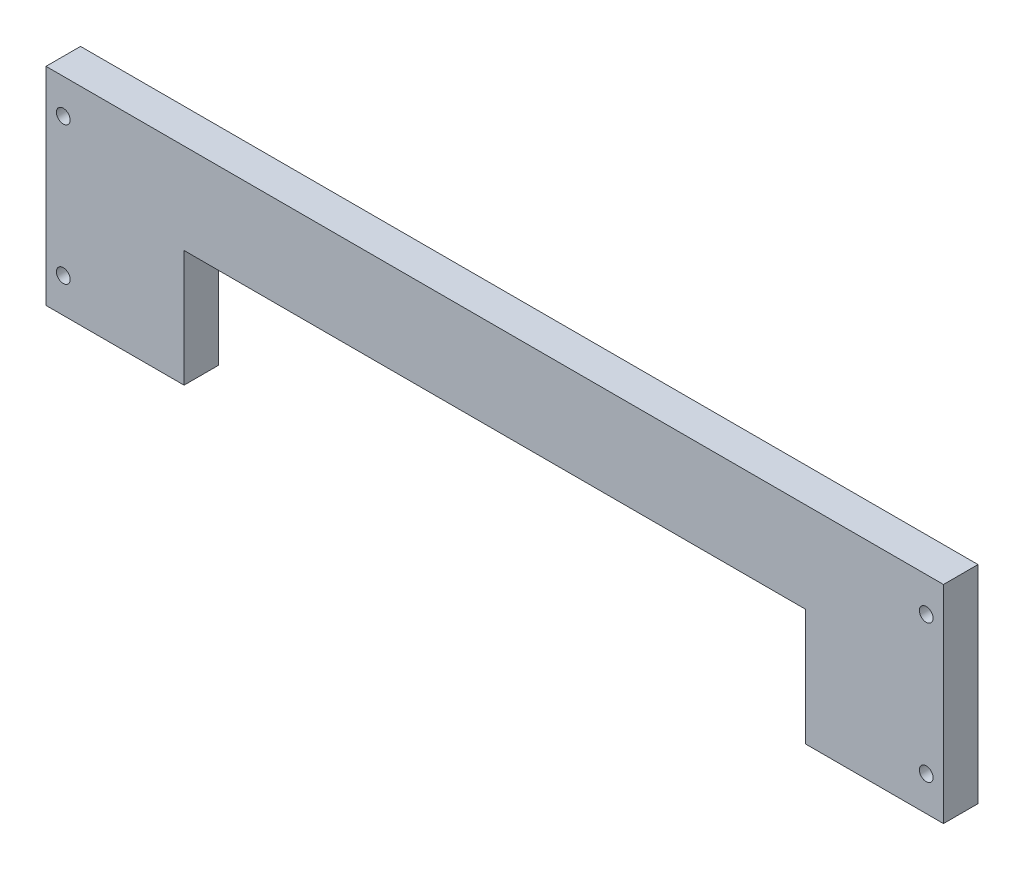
ISO-10303-21;
HEADER;
FILE_DESCRIPTION(('STEP AP214'),'2;1');
FILE_NAME('part.step','',(''),(''),'','','');
FILE_SCHEMA(('AUTOMOTIVE_DESIGN { 1 0 10303 214 1 1 1 1 }'));
ENDSEC;
DATA;
#1=APPLICATION_CONTEXT('core data for automotive mechanical design processes');
#2=APPLICATION_PROTOCOL_DEFINITION('international standard','automotive_design',2000,#1);
#3=PRODUCT_CONTEXT('',#1,'mechanical');
#4=PRODUCT('Part','Part','',(#3));
#5=PRODUCT_RELATED_PRODUCT_CATEGORY('part','',(#4));
#6=PRODUCT_DEFINITION_FORMATION('','',#4);
#7=PRODUCT_DEFINITION_CONTEXT('part definition',#1,'design');
#8=PRODUCT_DEFINITION('design','',#6,#7);
#9=PRODUCT_DEFINITION_SHAPE('','',#8);
#10=(LENGTH_UNIT() NAMED_UNIT(*) SI_UNIT(.MILLI.,.METRE.));
#11=(NAMED_UNIT(*) PLANE_ANGLE_UNIT() SI_UNIT($,.RADIAN.));
#12=(NAMED_UNIT(*) SI_UNIT($,.STERADIAN.) SOLID_ANGLE_UNIT());
#13=UNCERTAINTY_MEASURE_WITH_UNIT(LENGTH_MEASURE(1.E-05),#10,'distance_accuracy_value','');
#14=(GEOMETRIC_REPRESENTATION_CONTEXT(3) GLOBAL_UNCERTAINTY_ASSIGNED_CONTEXT((#13)) GLOBAL_UNIT_ASSIGNED_CONTEXT((#10,
#11,#12)) REPRESENTATION_CONTEXT('',''));
#15=CARTESIAN_POINT('',(0.,0.,0.));
#16=DIRECTION('',(0.,0.,1.));
#17=DIRECTION('',(1.,0.,0.));
#18=AXIS2_PLACEMENT_3D('',#15,#16,#17);
#19=CARTESIAN_POINT('',(-76.4670724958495,-44.9889500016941,12.7));
#20=DIRECTION('',(0.,1.,0.));
#21=DIRECTION('',(-1.,0.,0.));
#22=AXIS2_PLACEMENT_3D('',#19,#20,#21);
#23=PLANE('',#22);
#24=DIRECTION('',(1.,0.,0.));
#25=VECTOR('',#24,1.);
#26=CARTESIAN_POINT('',(-76.4670724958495,-44.9889500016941,12.7));
#27=LINE('',#26,#25);
#28=CARTESIAN_POINT('',(202.93292750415,-44.9889500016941,12.7));
#29=VERTEX_POINT('',#28);
#30=CARTESIAN_POINT('',(253.73292750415,-44.9889500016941,12.7));
#31=VERTEX_POINT('',#30);
#32=EDGE_CURVE('E130',#29,#31,#27,.T.);
#33=ORIENTED_EDGE('',*,*,#32,.F.);
#34=DIRECTION('',(0.,0.,-1.));
#35=VECTOR('',#34,1.);
#36=CARTESIAN_POINT('',(202.93292750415,-44.9889500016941,12.7));
#37=LINE('',#36,#35);
#38=CARTESIAN_POINT('',(202.93292750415,-44.9889500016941,0.));
#39=VERTEX_POINT('',#38);
#40=EDGE_CURVE('E114',#29,#39,#37,.T.);
#41=ORIENTED_EDGE('',*,*,#40,.T.);
#42=DIRECTION('',(1.,0.,0.));
#43=VECTOR('',#42,1.);
#44=CARTESIAN_POINT('',(-76.4670724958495,-44.9889500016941,0.));
#45=LINE('',#44,#43);
#46=CARTESIAN_POINT('',(253.73292750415,-44.9889500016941,0.));
#47=VERTEX_POINT('',#46);
#48=EDGE_CURVE('E157',#39,#47,#45,.T.);
#49=ORIENTED_EDGE('',*,*,#48,.T.);
#50=DIRECTION('',(0.,0.,-1.));
#51=VECTOR('',#50,1.);
#52=CARTESIAN_POINT('',(253.73292750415,-44.9889500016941,12.7));
#53=LINE('',#52,#51);
#54=EDGE_CURVE('E48',#31,#47,#53,.T.);
#55=ORIENTED_EDGE('',*,*,#54,.F.);
#56=EDGE_LOOP('',(#33,#41,#49,#55));
#57=FACE_BOUND('',#56,.T.);
#58=ADVANCED_FACE('F39',(#57),#23,.F.);
#59=CARTESIAN_POINT('',(-76.4670724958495,31.2110499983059,12.7));
#60=DIRECTION('',(1.,0.,0.));
#61=DIRECTION('',(0.,0.,-1.));
#62=AXIS2_PLACEMENT_3D('',#59,#60,#61);
#63=PLANE('',#62);
#64=DIRECTION('',(0.,-1.,0.));
#65=VECTOR('',#64,1.);
#66=CARTESIAN_POINT('',(-76.4670724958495,31.2110499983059,0.));
#67=LINE('',#66,#65);
#68=CARTESIAN_POINT('',(-76.4670724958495,31.2110499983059,0.));
#69=VERTEX_POINT('',#68);
#70=CARTESIAN_POINT('',(-76.4670724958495,-44.9889500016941,0.));
#71=VERTEX_POINT('',#70);
#72=EDGE_CURVE('E154',#69,#71,#67,.T.);
#73=ORIENTED_EDGE('',*,*,#72,.T.);
#74=DIRECTION('',(0.,0.,-1.));
#75=VECTOR('',#74,1.);
#76=CARTESIAN_POINT('',(-76.4670724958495,-44.9889500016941,12.7));
#77=LINE('',#76,#75);
#78=CARTESIAN_POINT('',(-76.4670724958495,-44.9889500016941,12.7));
#79=VERTEX_POINT('',#78);
#80=EDGE_CURVE('E11',#79,#71,#77,.T.);
#81=ORIENTED_EDGE('',*,*,#80,.F.);
#82=DIRECTION('',(0.,-1.,0.));
#83=VECTOR('',#82,1.);
#84=CARTESIAN_POINT('',(-76.4670724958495,31.2110499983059,12.7));
#85=LINE('',#84,#83);
#86=CARTESIAN_POINT('',(-76.4670724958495,31.2110499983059,12.7));
#87=VERTEX_POINT('',#86);
#88=EDGE_CURVE('E141',#87,#79,#85,.T.);
#89=ORIENTED_EDGE('',*,*,#88,.F.);
#90=DIRECTION('',(0.,0.,-1.));
#91=VECTOR('',#90,1.);
#92=CARTESIAN_POINT('',(-76.4670724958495,31.2110499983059,12.7));
#93=LINE('',#92,#91);
#94=EDGE_CURVE('E64',#87,#69,#93,.T.);
#95=ORIENTED_EDGE('',*,*,#94,.T.);
#96=EDGE_LOOP('',(#73,#81,#89,#95));
#97=FACE_BOUND('',#96,.T.);
#98=ADVANCED_FACE('F41',(#97),#63,.F.);
#99=CARTESIAN_POINT('',(-25.6670724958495,-44.9889500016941,0.));
#100=VERTEX_POINT('',#99);
#101=EDGE_CURVE('E159',#71,#100,#45,.T.);
#102=ORIENTED_EDGE('',*,*,#101,.T.);
#103=DIRECTION('',(0.,0.,-1.));
#104=VECTOR('',#103,1.);
#105=CARTESIAN_POINT('',(-25.6670724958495,-44.9889500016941,12.7));
#106=LINE('',#105,#104);
#107=CARTESIAN_POINT('',(-25.6670724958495,-44.9889500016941,12.7));
#108=VERTEX_POINT('',#107);
#109=EDGE_CURVE('E55',#108,#100,#106,.T.);
#110=ORIENTED_EDGE('',*,*,#109,.F.);
#111=EDGE_CURVE('E89',#79,#108,#27,.T.);
#112=ORIENTED_EDGE('',*,*,#111,.F.);
#113=ORIENTED_EDGE('',*,*,#80,.T.);
#114=EDGE_LOOP('',(#102,#110,#112,#113));
#115=FACE_BOUND('',#114,.T.);
#116=ADVANCED_FACE('F183',(#115),#23,.F.);
#117=CARTESIAN_POINT('',(253.73292750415,31.2110499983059,12.7));
#118=DIRECTION('',(1.,0.,0.));
#119=DIRECTION('',(0.,0.,-1.));
#120=AXIS2_PLACEMENT_3D('',#117,#118,#119);
#121=PLANE('',#120);
#122=DIRECTION('',(0.,-1.,0.));
#123=VECTOR('',#122,1.);
#124=CARTESIAN_POINT('',(253.73292750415,31.2110499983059,0.));
#125=LINE('',#124,#123);
#126=CARTESIAN_POINT('',(253.73292750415,31.2110499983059,0.));
#127=VERTEX_POINT('',#126);
#128=EDGE_CURVE('E163',#127,#47,#125,.T.);
#129=ORIENTED_EDGE('',*,*,#128,.F.);
#130=DIRECTION('',(0.,0.,-1.));
#131=VECTOR('',#130,1.);
#132=CARTESIAN_POINT('',(253.73292750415,31.2110499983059,12.7));
#133=LINE('',#132,#131);
#134=CARTESIAN_POINT('',(253.73292750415,31.2110499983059,12.7));
#135=VERTEX_POINT('',#134);
#136=EDGE_CURVE('E172',#135,#127,#133,.T.);
#137=ORIENTED_EDGE('',*,*,#136,.F.);
#138=DIRECTION('',(0.,-1.,0.));
#139=VECTOR('',#138,1.);
#140=CARTESIAN_POINT('',(253.73292750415,31.2110499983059,12.7));
#141=LINE('',#140,#139);
#142=EDGE_CURVE('E145',#135,#31,#141,.T.);
#143=ORIENTED_EDGE('',*,*,#142,.T.);
#144=ORIENTED_EDGE('',*,*,#54,.T.);
#145=EDGE_LOOP('',(#129,#137,#143,#144));
#146=FACE_BOUND('',#145,.T.);
#147=ADVANCED_FACE('F177',(#146),#121,.T.);
#148=CARTESIAN_POINT('',(-76.4670724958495,31.2110499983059,12.7));
#149=DIRECTION('',(0.,1.,0.));
#150=DIRECTION('',(0.,0.,1.));
#151=AXIS2_PLACEMENT_3D('',#148,#149,#150);
#152=PLANE('',#151);
#153=DIRECTION('',(1.,0.,0.));
#154=VECTOR('',#153,1.);
#155=CARTESIAN_POINT('',(-76.4670724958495,31.2110499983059,0.));
#156=LINE('',#155,#154);
#157=EDGE_CURVE('E146',#69,#127,#156,.T.);
#158=ORIENTED_EDGE('',*,*,#157,.F.);
#159=ORIENTED_EDGE('',*,*,#94,.F.);
#160=DIRECTION('',(1.,0.,0.));
#161=VECTOR('',#160,1.);
#162=CARTESIAN_POINT('',(-76.4670724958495,31.2110499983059,12.7));
#163=LINE('',#162,#161);
#164=EDGE_CURVE('E151',#87,#135,#163,.T.);
#165=ORIENTED_EDGE('',*,*,#164,.T.);
#166=ORIENTED_EDGE('',*,*,#136,.T.);
#167=EDGE_LOOP('',(#158,#159,#165,#166));
#168=FACE_BOUND('',#167,.T.);
#169=ADVANCED_FACE('F180',(#168),#152,.T.);
#170=CARTESIAN_POINT('',(0.,0.,12.7));
#171=DIRECTION('',(0.,0.,1.));
#172=DIRECTION('',(1.,0.,0.));
#173=AXIS2_PLACEMENT_3D('',#170,#171,#172);
#174=PLANE('',#173);
#175=CARTESIAN_POINT('',(247.38292750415,18.5110499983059,12.7));
#176=DIRECTION('',(0.,0.,-1.));
#177=DIRECTION('',(-1.,0.,0.));
#178=AXIS2_PLACEMENT_3D('',#175,#176,#177);
#179=CIRCLE('',#178,2.52730000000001);
#180=CARTESIAN_POINT('',(244.85562750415,18.5110499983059,12.7));
#181=VERTEX_POINT('',#180);
#182=EDGE_CURVE('E241',#181,#181,#179,.T.);
#183=ORIENTED_EDGE('',*,*,#182,.T.);
#184=EDGE_LOOP('',(#183));
#185=FACE_BOUND('',#184,.T.);
#186=CARTESIAN_POINT('',(247.382927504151,-32.2889500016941,12.7));
#187=DIRECTION('',(0.,0.,-1.));
#188=DIRECTION('',(-1.,0.,0.));
#189=AXIS2_PLACEMENT_3D('',#186,#187,#188);
#190=CIRCLE('',#189,2.52730000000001);
#191=CARTESIAN_POINT('',(244.855627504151,-32.2889500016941,12.7));
#192=VERTEX_POINT('',#191);
#193=EDGE_CURVE('E229',#192,#192,#190,.T.);
#194=ORIENTED_EDGE('',*,*,#193,.T.);
#195=EDGE_LOOP('',(#194));
#196=FACE_BOUND('',#195,.T.);
#197=CARTESIAN_POINT('',(-70.1170724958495,18.5110499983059,12.7));
#198=DIRECTION('',(0.,0.,-1.));
#199=DIRECTION('',(-1.,0.,0.));
#200=AXIS2_PLACEMENT_3D('',#197,#198,#199);
#201=CIRCLE('',#200,2.5273);
#202=CARTESIAN_POINT('',(-72.6443724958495,18.5110499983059,12.7));
#203=VERTEX_POINT('',#202);
#204=EDGE_CURVE('E217',#203,#203,#201,.T.);
#205=ORIENTED_EDGE('',*,*,#204,.T.);
#206=EDGE_LOOP('',(#205));
#207=FACE_BOUND('',#206,.T.);
#208=CARTESIAN_POINT('',(-70.1170724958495,-32.2889500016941,12.7));
#209=DIRECTION('',(0.,0.,-1.));
#210=DIRECTION('',(-1.,0.,0.));
#211=AXIS2_PLACEMENT_3D('',#208,#209,#210);
#212=CIRCLE('',#211,2.5273);
#213=CARTESIAN_POINT('',(-72.6443724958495,-32.2889500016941,12.7));
#214=VERTEX_POINT('',#213);
#215=EDGE_CURVE('E192',#214,#214,#212,.T.);
#216=ORIENTED_EDGE('',*,*,#215,.T.);
#217=EDGE_LOOP('',(#216));
#218=FACE_BOUND('',#217,.T.);
#219=DIRECTION('',(0.,-1.,0.));
#220=VECTOR('',#219,1.);
#221=CARTESIAN_POINT('',(202.93292750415,-44.9889500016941,12.7));
#222=LINE('',#221,#220);
#223=CARTESIAN_POINT('',(202.93292750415,-2.06295000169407,12.7));
#224=VERTEX_POINT('',#223);
#225=EDGE_CURVE('E117',#224,#29,#222,.T.);
#226=ORIENTED_EDGE('',*,*,#225,.T.);
#227=ORIENTED_EDGE('',*,*,#32,.T.);
#228=ORIENTED_EDGE('',*,*,#142,.F.);
#229=ORIENTED_EDGE('',*,*,#164,.F.);
#230=ORIENTED_EDGE('',*,*,#88,.T.);
#231=ORIENTED_EDGE('',*,*,#111,.T.);
#232=DIRECTION('',(0.,1.,0.));
#233=VECTOR('',#232,1.);
#234=CARTESIAN_POINT('',(-25.6670724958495,-44.9889500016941,12.7));
#235=LINE('',#234,#233);
#236=CARTESIAN_POINT('',(-25.6670724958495,-2.06295000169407,12.7));
#237=VERTEX_POINT('',#236);
#238=EDGE_CURVE('E135',#108,#237,#235,.T.);
#239=ORIENTED_EDGE('',*,*,#238,.T.);
#240=DIRECTION('',(1.,0.,0.));
#241=VECTOR('',#240,1.);
#242=CARTESIAN_POINT('',(202.93292750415,-2.06295000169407,12.7));
#243=LINE('',#242,#241);
#244=EDGE_CURVE('E125',#237,#224,#243,.T.);
#245=ORIENTED_EDGE('',*,*,#244,.T.);
#246=EDGE_LOOP('',(#226,#227,#228,#229,#230,#231,#239,#245));
#247=FACE_BOUND('',#246,.T.);
#248=ADVANCED_FACE('F128',(#185,#196,#207,#218,#247),#174,.T.);
#249=CARTESIAN_POINT('',(0.,0.,0.));
#250=DIRECTION('',(0.,0.,1.));
#251=DIRECTION('',(1.,0.,0.));
#252=AXIS2_PLACEMENT_3D('',#249,#250,#251);
#253=PLANE('',#252);
#254=CARTESIAN_POINT('',(247.38292750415,18.5110499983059,0.));
#255=DIRECTION('',(0.,0.,-1.));
#256=DIRECTION('',(-1.,0.,0.));
#257=AXIS2_PLACEMENT_3D('',#254,#255,#256);
#258=CIRCLE('',#257,4.60375000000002);
#259=CARTESIAN_POINT('',(242.77917750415,18.5110499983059,0.));
#260=VERTEX_POINT('',#259);
#261=EDGE_CURVE('E249',#260,#260,#258,.T.);
#262=ORIENTED_EDGE('',*,*,#261,.F.);
#263=EDGE_LOOP('',(#262));
#264=FACE_BOUND('',#263,.T.);
#265=CARTESIAN_POINT('',(247.382927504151,-32.2889500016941,0.));
#266=DIRECTION('',(0.,0.,-1.));
#267=DIRECTION('',(-1.,0.,0.));
#268=AXIS2_PLACEMENT_3D('',#265,#266,#267);
#269=CIRCLE('',#268,4.60374999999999);
#270=CARTESIAN_POINT('',(242.779177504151,-32.2889500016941,0.));
#271=VERTEX_POINT('',#270);
#272=EDGE_CURVE('E237',#271,#271,#269,.T.);
#273=ORIENTED_EDGE('',*,*,#272,.F.);
#274=EDGE_LOOP('',(#273));
#275=FACE_BOUND('',#274,.T.);
#276=CARTESIAN_POINT('',(-70.1170724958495,18.5110499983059,0.));
#277=DIRECTION('',(0.,0.,-1.));
#278=DIRECTION('',(-1.,0.,0.));
#279=AXIS2_PLACEMENT_3D('',#276,#277,#278);
#280=CIRCLE('',#279,4.60375);
#281=CARTESIAN_POINT('',(-74.7208224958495,18.5110499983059,0.));
#282=VERTEX_POINT('',#281);
#283=EDGE_CURVE('E225',#282,#282,#280,.T.);
#284=ORIENTED_EDGE('',*,*,#283,.F.);
#285=EDGE_LOOP('',(#284));
#286=FACE_BOUND('',#285,.T.);
#287=CARTESIAN_POINT('',(-70.1170724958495,-32.2889500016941,0.));
#288=DIRECTION('',(0.,0.,-1.));
#289=DIRECTION('',(-1.,0.,0.));
#290=AXIS2_PLACEMENT_3D('',#287,#288,#289);
#291=CIRCLE('',#290,4.60375);
#292=CARTESIAN_POINT('',(-74.7208224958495,-32.2889500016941,0.));
#293=VERTEX_POINT('',#292);
#294=EDGE_CURVE('E213',#293,#293,#291,.T.);
#295=ORIENTED_EDGE('',*,*,#294,.F.);
#296=EDGE_LOOP('',(#295));
#297=FACE_BOUND('',#296,.T.);
#298=ORIENTED_EDGE('',*,*,#48,.F.);
#299=DIRECTION('',(0.,-1.,0.));
#300=VECTOR('',#299,1.);
#301=CARTESIAN_POINT('',(202.93292750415,-44.9889500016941,0.));
#302=LINE('',#301,#300);
#303=CARTESIAN_POINT('',(202.93292750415,-2.06295000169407,0.));
#304=VERTEX_POINT('',#303);
#305=EDGE_CURVE('E120',#304,#39,#302,.T.);
#306=ORIENTED_EDGE('',*,*,#305,.F.);
#307=DIRECTION('',(1.,0.,0.));
#308=VECTOR('',#307,1.);
#309=CARTESIAN_POINT('',(202.93292750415,-2.06295000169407,0.));
#310=LINE('',#309,#308);
#311=CARTESIAN_POINT('',(-25.6670724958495,-2.06295000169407,0.));
#312=VERTEX_POINT('',#311);
#313=EDGE_CURVE('E136',#312,#304,#310,.T.);
#314=ORIENTED_EDGE('',*,*,#313,.F.);
#315=DIRECTION('',(0.,1.,0.));
#316=VECTOR('',#315,1.);
#317=CARTESIAN_POINT('',(-25.6670724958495,-44.9889500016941,0.));
#318=LINE('',#317,#316);
#319=EDGE_CURVE('E185',#100,#312,#318,.T.);
#320=ORIENTED_EDGE('',*,*,#319,.F.);
#321=ORIENTED_EDGE('',*,*,#101,.F.);
#322=ORIENTED_EDGE('',*,*,#72,.F.);
#323=ORIENTED_EDGE('',*,*,#157,.T.);
#324=ORIENTED_EDGE('',*,*,#128,.T.);
#325=EDGE_LOOP('',(#298,#306,#314,#320,#321,#322,#323,#324));
#326=FACE_BOUND('',#325,.T.);
#327=ADVANCED_FACE('F179',(#264,#275,#286,#297,#326),#253,.F.);
#328=CARTESIAN_POINT('',(202.93292750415,-44.9889500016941,12.7));
#329=DIRECTION('',(1.,0.,0.));
#330=DIRECTION('',(0.,0.,-1.));
#331=AXIS2_PLACEMENT_3D('',#328,#329,#330);
#332=PLANE('',#331);
#333=ORIENTED_EDGE('',*,*,#305,.T.);
#334=ORIENTED_EDGE('',*,*,#40,.F.);
#335=ORIENTED_EDGE('',*,*,#225,.F.);
#336=DIRECTION('',(0.,0.,-1.));
#337=VECTOR('',#336,1.);
#338=CARTESIAN_POINT('',(202.93292750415,-2.06295000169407,12.7));
#339=LINE('',#338,#337);
#340=EDGE_CURVE('E158',#224,#304,#339,.T.);
#341=ORIENTED_EDGE('',*,*,#340,.T.);
#342=EDGE_LOOP('',(#333,#334,#335,#341));
#343=FACE_BOUND('',#342,.T.);
#344=ADVANCED_FACE('F116',(#343),#332,.F.);
#345=CARTESIAN_POINT('',(202.93292750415,-2.06295000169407,12.7));
#346=DIRECTION('',(0.,1.,0.));
#347=DIRECTION('',(0.,0.,1.));
#348=AXIS2_PLACEMENT_3D('',#345,#346,#347);
#349=PLANE('',#348);
#350=ORIENTED_EDGE('',*,*,#313,.T.);
#351=ORIENTED_EDGE('',*,*,#340,.F.);
#352=ORIENTED_EDGE('',*,*,#244,.F.);
#353=DIRECTION('',(0.,0.,-1.));
#354=VECTOR('',#353,1.);
#355=CARTESIAN_POINT('',(-25.6670724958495,-2.06295000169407,12.7));
#356=LINE('',#355,#354);
#357=EDGE_CURVE('E198',#237,#312,#356,.T.);
#358=ORIENTED_EDGE('',*,*,#357,.T.);
#359=EDGE_LOOP('',(#350,#351,#352,#358));
#360=FACE_BOUND('',#359,.T.);
#361=ADVANCED_FACE('F301',(#360),#349,.F.);
#362=CARTESIAN_POINT('',(-25.6670724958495,-44.9889500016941,12.7));
#363=DIRECTION('',(-1.,0.,0.));
#364=DIRECTION('',(0.,0.,1.));
#365=AXIS2_PLACEMENT_3D('',#362,#363,#364);
#366=PLANE('',#365);
#367=ORIENTED_EDGE('',*,*,#319,.T.);
#368=ORIENTED_EDGE('',*,*,#357,.F.);
#369=ORIENTED_EDGE('',*,*,#238,.F.);
#370=ORIENTED_EDGE('',*,*,#109,.T.);
#371=EDGE_LOOP('',(#367,#368,#369,#370));
#372=FACE_BOUND('',#371,.T.);
#373=ADVANCED_FACE('F278',(#372),#366,.F.);
#374=CARTESIAN_POINT('',(-70.1170724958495,-32.2889500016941,0.));
#375=DIRECTION('',(0.,0.,-1.));
#376=DIRECTION('',(-1.,0.,0.));
#377=AXIS2_PLACEMENT_3D('',#374,#375,#376);
#378=CYLINDRICAL_SURFACE('',#377,2.52729999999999);
#379=ORIENTED_EDGE('',*,*,#215,.F.);
#380=EDGE_LOOP('',(#379));
#381=FACE_BOUND('',#380,.T.);
#382=CARTESIAN_POINT('',(-70.1170724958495,-32.2889500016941,2.07645000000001));
#383=DIRECTION('',(0.,0.,-1.));
#384=DIRECTION('',(-1.,0.,0.));
#385=AXIS2_PLACEMENT_3D('',#382,#383,#384);
#386=CIRCLE('',#385,2.52729999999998);
#387=CARTESIAN_POINT('',(-72.6443724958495,-32.2889500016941,2.07645000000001));
#388=VERTEX_POINT('',#387);
#389=EDGE_CURVE('E209',#388,#388,#386,.T.);
#390=ORIENTED_EDGE('',*,*,#389,.T.);
#391=EDGE_LOOP('',(#390));
#392=FACE_BOUND('',#391,.T.);
#393=ADVANCED_FACE('F268',(#381,#392),#378,.F.);
#394=CARTESIAN_POINT('',(-70.1170724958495,-32.2889500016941,0.));
#395=DIRECTION('',(0.,0.,-1.));
#396=DIRECTION('',(-1.,0.,0.));
#397=AXIS2_PLACEMENT_3D('',#394,#395,#396);
#398=CONICAL_SURFACE('',#397,4.60375,0.785398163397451);
#399=ORIENTED_EDGE('',*,*,#389,.F.);
#400=EDGE_LOOP('',(#399));
#401=FACE_BOUND('',#400,.T.);
#402=ORIENTED_EDGE('',*,*,#294,.T.);
#403=EDGE_LOOP('',(#402));
#404=FACE_BOUND('',#403,.T.);
#405=ADVANCED_FACE('F265',(#401,#404),#398,.F.);
#406=CARTESIAN_POINT('',(-70.1170724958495,18.5110499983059,0.));
#407=DIRECTION('',(0.,0.,-1.));
#408=DIRECTION('',(-1.,0.,0.));
#409=AXIS2_PLACEMENT_3D('',#406,#407,#408);
#410=CYLINDRICAL_SURFACE('',#409,2.52729999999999);
#411=ORIENTED_EDGE('',*,*,#204,.F.);
#412=EDGE_LOOP('',(#411));
#413=FACE_BOUND('',#412,.T.);
#414=CARTESIAN_POINT('',(-70.1170724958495,18.5110499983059,2.07645000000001));
#415=DIRECTION('',(0.,0.,-1.));
#416=DIRECTION('',(-1.,0.,0.));
#417=AXIS2_PLACEMENT_3D('',#414,#415,#416);
#418=CIRCLE('',#417,2.52729999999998);
#419=CARTESIAN_POINT('',(-72.6443724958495,18.5110499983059,2.07645000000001));
#420=VERTEX_POINT('',#419);
#421=EDGE_CURVE('E221',#420,#420,#418,.T.);
#422=ORIENTED_EDGE('',*,*,#421,.T.);
#423=EDGE_LOOP('',(#422));
#424=FACE_BOUND('',#423,.T.);
#425=ADVANCED_FACE('F267',(#413,#424),#410,.F.);
#426=CARTESIAN_POINT('',(-70.1170724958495,18.5110499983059,0.));
#427=DIRECTION('',(0.,0.,-1.));
#428=DIRECTION('',(-1.,0.,0.));
#429=AXIS2_PLACEMENT_3D('',#426,#427,#428);
#430=CONICAL_SURFACE('',#429,4.60375,0.785398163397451);
#431=ORIENTED_EDGE('',*,*,#421,.F.);
#432=EDGE_LOOP('',(#431));
#433=FACE_BOUND('',#432,.T.);
#434=ORIENTED_EDGE('',*,*,#283,.T.);
#435=EDGE_LOOP('',(#434));
#436=FACE_BOUND('',#435,.T.);
#437=ADVANCED_FACE('F275',(#433,#436),#430,.F.);
#438=CARTESIAN_POINT('',(247.382927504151,-32.2889500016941,0.));
#439=DIRECTION('',(0.,0.,-1.));
#440=DIRECTION('',(-1.,0.,0.));
#441=AXIS2_PLACEMENT_3D('',#438,#439,#440);
#442=CYLINDRICAL_SURFACE('',#441,2.5273);
#443=ORIENTED_EDGE('',*,*,#193,.F.);
#444=EDGE_LOOP('',(#443));
#445=FACE_BOUND('',#444,.T.);
#446=CARTESIAN_POINT('',(247.382927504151,-32.2889500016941,2.07645000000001));
#447=DIRECTION('',(0.,0.,-1.));
#448=DIRECTION('',(-1.,0.,0.));
#449=AXIS2_PLACEMENT_3D('',#446,#447,#448);
#450=CIRCLE('',#449,2.52729999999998);
#451=CARTESIAN_POINT('',(244.855627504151,-32.2889500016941,2.07645000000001));
#452=VERTEX_POINT('',#451);
#453=EDGE_CURVE('E233',#452,#452,#450,.T.);
#454=ORIENTED_EDGE('',*,*,#453,.T.);
#455=EDGE_LOOP('',(#454));
#456=FACE_BOUND('',#455,.T.);
#457=ADVANCED_FACE('F341',(#445,#456),#442,.F.);
#458=CARTESIAN_POINT('',(247.382927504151,-32.2889500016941,0.));
#459=DIRECTION('',(0.,0.,-1.));
#460=DIRECTION('',(-1.,0.,0.));
#461=AXIS2_PLACEMENT_3D('',#458,#459,#460);
#462=CONICAL_SURFACE('',#461,4.60374999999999,0.785398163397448);
#463=ORIENTED_EDGE('',*,*,#453,.F.);
#464=EDGE_LOOP('',(#463));
#465=FACE_BOUND('',#464,.T.);
#466=ORIENTED_EDGE('',*,*,#272,.T.);
#467=EDGE_LOOP('',(#466));
#468=FACE_BOUND('',#467,.T.);
#469=ADVANCED_FACE('F351',(#465,#468),#462,.F.);
#470=CARTESIAN_POINT('',(247.38292750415,18.5110499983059,0.));
#471=DIRECTION('',(0.,0.,-1.));
#472=DIRECTION('',(-1.,0.,0.));
#473=AXIS2_PLACEMENT_3D('',#470,#471,#472);
#474=CYLINDRICAL_SURFACE('',#473,2.5273);
#475=ORIENTED_EDGE('',*,*,#182,.F.);
#476=EDGE_LOOP('',(#475));
#477=FACE_BOUND('',#476,.T.);
#478=CARTESIAN_POINT('',(247.38292750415,18.5110499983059,2.07645000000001));
#479=DIRECTION('',(0.,0.,-1.));
#480=DIRECTION('',(-1.,0.,0.));
#481=AXIS2_PLACEMENT_3D('',#478,#479,#480);
#482=CIRCLE('',#481,2.52729999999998);
#483=CARTESIAN_POINT('',(244.855627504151,18.5110499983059,2.07645000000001));
#484=VERTEX_POINT('',#483);
#485=EDGE_CURVE('E245',#484,#484,#482,.T.);
#486=ORIENTED_EDGE('',*,*,#485,.T.);
#487=EDGE_LOOP('',(#486));
#488=FACE_BOUND('',#487,.T.);
#489=ADVANCED_FACE('F361',(#477,#488),#474,.F.);
#490=CARTESIAN_POINT('',(247.38292750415,18.5110499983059,0.));
#491=DIRECTION('',(0.,0.,-1.));
#492=DIRECTION('',(-1.,0.,0.));
#493=AXIS2_PLACEMENT_3D('',#490,#491,#492);
#494=CONICAL_SURFACE('',#493,4.60375000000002,0.785398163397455);
#495=ORIENTED_EDGE('',*,*,#485,.F.);
#496=EDGE_LOOP('',(#495));
#497=FACE_BOUND('',#496,.T.);
#498=ORIENTED_EDGE('',*,*,#261,.T.);
#499=EDGE_LOOP('',(#498));
#500=FACE_BOUND('',#499,.T.);
#501=ADVANCED_FACE('F254',(#497,#500),#494,.F.);
#502=CLOSED_SHELL('',(#58,#98,#116,#147,#169,#248,#327,#344,#361,#373,#393,#405,#425,#437,#457,
#469,#489,#501));
#503=MANIFOLD_SOLID_BREP('B2',#502);
#504=ADVANCED_BREP_SHAPE_REPRESENTATION('',(#18,#503),#14);
#505=SHAPE_DEFINITION_REPRESENTATION(#9,#504);
ENDSEC;
END-ISO-10303-21;
